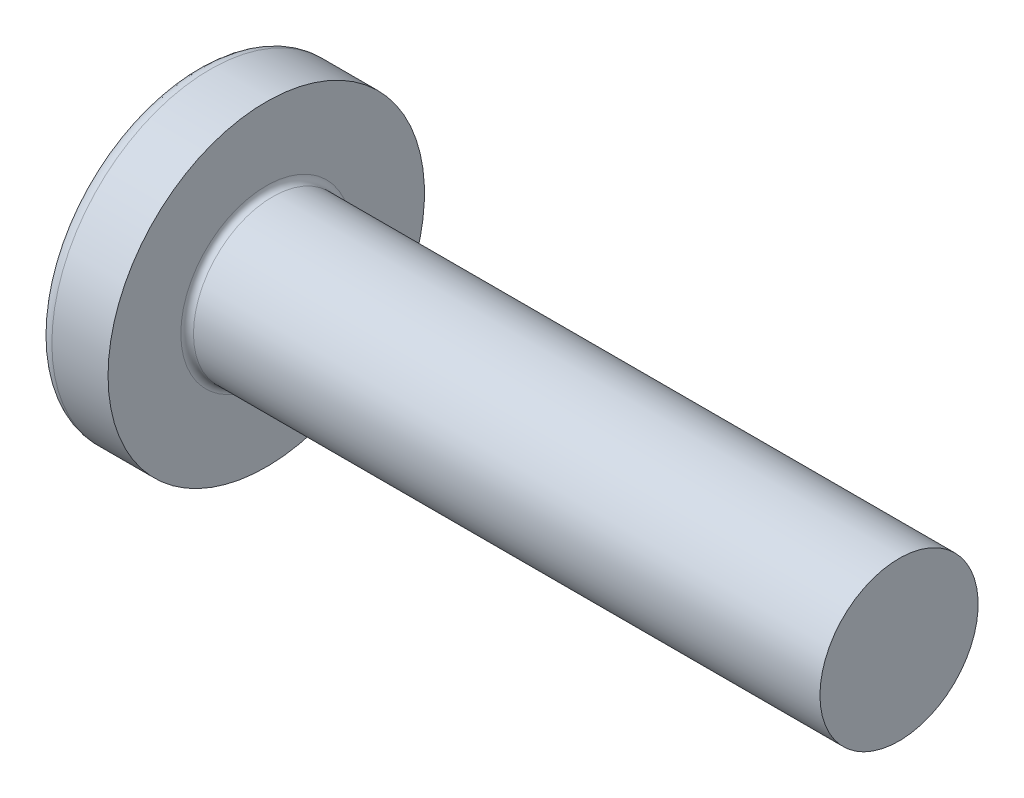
from build123d import *

# Parameters (mm, degrees)
FILLET1_R    = 0.4
RECPAT_COUNT = 2
RECPAT_ANGLE = 90


with BuildPart() as part:
    # BodySke → BaseBody (revolve)
    with BuildSketch(Plane.XY, mode=Mode.PRIVATE) as basebody_sk:
        with BuildLine():
            Line((0, 0), (47.5, 0))
            Line((47.5, 0), (47.5, 5))
            Line((47.5, 5), (7.5, 5))
            Line((7.5, 5), (7.5, 10))
            Line((7.5, 10), (3.950103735, 10))
            ThreePointArc((3.950103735, 10), (3.548946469, 9.905650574), (3.231897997, 9.642384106))
            ThreePointArc((3.231897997, 9.642384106), (0.82947542, 5.084799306), (0, 0))
        make_face()
    revolve(basebody_sk.sketch.rotate(Axis((0, 0, 0), (1, 0, 0)), 90), axis=Axis((0, 0, 0), (1, 0, 0)))

    # Fillet1
    fillet1_edges = [part.edges().sort_by_distance(p)[0] for p in [
        (7.5, 0, -5),
    ]]
    fillet(fillet1_edges, radius=FILLET1_R)

    # RecessTopSke → Recess section 0
    with BuildSketch(Plane(origin=(0, 0, 0), x_dir=(0, 0, -1), z_dir=(1, 0, 0))):
        with BuildLine():
            Line((-1.08, 4.95), (1.08, 4.95))
            Line((1.08, 4.95), (1.08, -4.95))
            Line((1.08, -4.95), (-1.08, -4.95))
            Line((-1.08, -4.95), (-1.08, 4.95))
        make_face()
    # RecessBottomSke → Recess section 1
    with BuildSketch(Plane(origin=(5.69, 0, 0), x_dir=(0, 0, -1), z_dir=(1, 0, 0))):
        with BuildLine():
            Line((-1.08, -2.1285), (1.08, -2.1285))
            Line((1.08, -2.1285), (1.08, 2.1285))
            Line((1.08, 2.1285), (-1.08, 2.1285))
            Line((-1.08, 2.1285), (-1.08, -2.1285))
        make_face()
    recess = loft(mode=Mode.SUBTRACT)

    # RecPat: Recess ×2 about axis
    recpat_axis = Axis((0, 0, 0), (1, 0, 0))
    for i in range(1, RECPAT_COUNT):
        add(recess.rotate(recpat_axis, i * RECPAT_ANGLE / (RECPAT_COUNT - 1)), mode=Mode.SUBTRACT)

    # RecessCoreSke → RecessCore (revolve, cut)
    with BuildSketch(Plane.XY, mode=Mode.PRIVATE) as recesscore_sk:
        Polygon((0, 0), (6.317257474, 0), (5.69, 1.9305), (0, 2.32838356), align=None)
    revolve(recesscore_sk.sketch.rotate(Axis((0, 0, 0), (1, 0, 0)), 346.777937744), axis=Axis((0, 0, 0), (1, 0, 0)), mode=Mode.SUBTRACT)


solid = part.part
